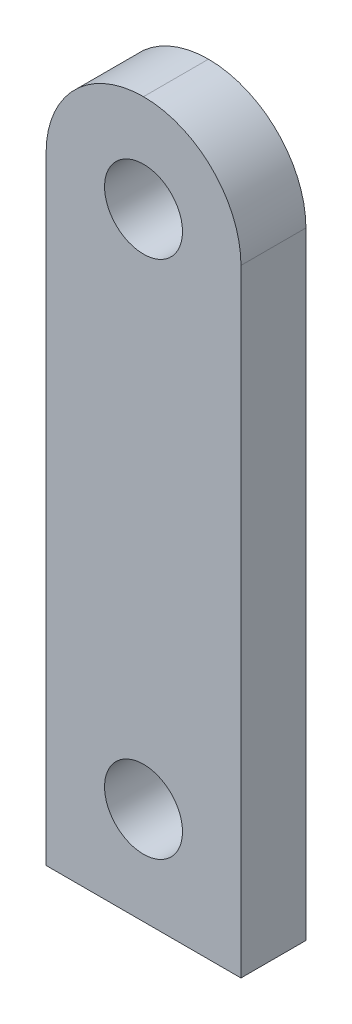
ISO-10303-21;
HEADER;
FILE_DESCRIPTION(('STEP AP214'),'2;1');
FILE_NAME('part.step','',(''),(''),'','','');
FILE_SCHEMA(('AUTOMOTIVE_DESIGN { 1 0 10303 214 1 1 1 1 }'));
ENDSEC;
DATA;
#1=APPLICATION_CONTEXT('core data for automotive mechanical design processes');
#2=APPLICATION_PROTOCOL_DEFINITION('international standard','automotive_design',2000,#1);
#3=PRODUCT_CONTEXT('',#1,'mechanical');
#4=PRODUCT('Part','Part','',(#3));
#5=PRODUCT_RELATED_PRODUCT_CATEGORY('part','',(#4));
#6=PRODUCT_DEFINITION_FORMATION('','',#4);
#7=PRODUCT_DEFINITION_CONTEXT('part definition',#1,'design');
#8=PRODUCT_DEFINITION('design','',#6,#7);
#9=PRODUCT_DEFINITION_SHAPE('','',#8);
#10=(LENGTH_UNIT() NAMED_UNIT(*) SI_UNIT(.MILLI.,.METRE.));
#11=(NAMED_UNIT(*) PLANE_ANGLE_UNIT() SI_UNIT($,.RADIAN.));
#12=(NAMED_UNIT(*) SI_UNIT($,.STERADIAN.) SOLID_ANGLE_UNIT());
#13=UNCERTAINTY_MEASURE_WITH_UNIT(LENGTH_MEASURE(1.E-05),#10,'distance_accuracy_value','');
#14=(GEOMETRIC_REPRESENTATION_CONTEXT(3) GLOBAL_UNCERTAINTY_ASSIGNED_CONTEXT((#13)) GLOBAL_UNIT_ASSIGNED_CONTEXT((#10,
#11,#12)) REPRESENTATION_CONTEXT('',''));
#15=CARTESIAN_POINT('',(0.,0.,0.));
#16=DIRECTION('',(0.,0.,1.));
#17=DIRECTION('',(1.,0.,0.));
#18=AXIS2_PLACEMENT_3D('',#15,#16,#17);
#19=CARTESIAN_POINT('',(0.,0.,10.));
#20=DIRECTION('',(0.,0.,-1.));
#21=DIRECTION('',(-1.,0.,0.));
#22=AXIS2_PLACEMENT_3D('',#19,#20,#21);
#23=PLANE('',#22);
#24=CARTESIAN_POINT('',(-15.,-15.,10.));
#25=DIRECTION('',(0.,0.,1.));
#26=DIRECTION('',(1.,0.,0.));
#27=AXIS2_PLACEMENT_3D('',#24,#25,#26);
#28=CIRCLE('',#27,6.);
#29=CARTESIAN_POINT('',(-8.99999999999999,-15.,10.));
#30=VERTEX_POINT('',#29);
#31=EDGE_CURVE('E109',#30,#30,#28,.T.);
#32=ORIENTED_EDGE('',*,*,#31,.F.);
#33=EDGE_LOOP('',(#32));
#34=FACE_BOUND('',#33,.T.);
#35=CARTESIAN_POINT('',(-15.,-15.,10.));
#36=DIRECTION('',(0.,0.,-1.));
#37=DIRECTION('',(-1.,0.,0.));
#38=AXIS2_PLACEMENT_3D('',#35,#36,#37);
#39=CIRCLE('',#38,15.);
#40=CARTESIAN_POINT('',(0.,-15.,10.));
#41=VERTEX_POINT('',#40);
#42=CARTESIAN_POINT('',(-15.,0.,10.));
#43=VERTEX_POINT('',#42);
#44=EDGE_CURVE('E53',#41,#43,#39,.F.);
#45=ORIENTED_EDGE('',*,*,#44,.T.);
#46=CARTESIAN_POINT('',(-15.,-15.,10.));
#47=DIRECTION('',(0.,0.,-1.));
#48=DIRECTION('',(-1.,0.,0.));
#49=AXIS2_PLACEMENT_3D('',#46,#47,#48);
#50=CIRCLE('',#49,15.);
#51=CARTESIAN_POINT('',(-30.,-15.,10.));
#52=VERTEX_POINT('',#51);
#53=EDGE_CURVE('E41',#43,#52,#50,.F.);
#54=ORIENTED_EDGE('',*,*,#53,.T.);
#55=DIRECTION('',(0.,-1.,0.));
#56=VECTOR('',#55,1.);
#57=CARTESIAN_POINT('',(-30.,0.,10.));
#58=LINE('',#57,#56);
#59=CARTESIAN_POINT('',(-30.,-110.,10.));
#60=VERTEX_POINT('',#59);
#61=EDGE_CURVE('E78',#52,#60,#58,.T.);
#62=ORIENTED_EDGE('',*,*,#61,.T.);
#63=DIRECTION('',(1.,0.,0.));
#64=VECTOR('',#63,1.);
#65=CARTESIAN_POINT('',(-30.,-110.,10.));
#66=LINE('',#65,#64);
#67=CARTESIAN_POINT('',(0.,-110.,10.));
#68=VERTEX_POINT('',#67);
#69=EDGE_CURVE('E82',#60,#68,#66,.T.);
#70=ORIENTED_EDGE('',*,*,#69,.T.);
#71=DIRECTION('',(0.,1.,0.));
#72=VECTOR('',#71,1.);
#73=CARTESIAN_POINT('',(0.,-110.,10.));
#74=LINE('',#73,#72);
#75=EDGE_CURVE('E102',#68,#41,#74,.T.);
#76=ORIENTED_EDGE('',*,*,#75,.T.);
#77=EDGE_LOOP('',(#45,#54,#62,#70,#76));
#78=FACE_BOUND('',#77,.T.);
#79=CARTESIAN_POINT('',(-15.,-95.,10.));
#80=DIRECTION('',(0.,0.,1.));
#81=DIRECTION('',(1.,0.,0.));
#82=AXIS2_PLACEMENT_3D('',#79,#80,#81);
#83=CIRCLE('',#82,6.00000000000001);
#84=CARTESIAN_POINT('',(-8.99999999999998,-95.,10.));
#85=VERTEX_POINT('',#84);
#86=EDGE_CURVE('E130',#85,#85,#83,.T.);
#87=ORIENTED_EDGE('',*,*,#86,.F.);
#88=EDGE_LOOP('',(#87));
#89=FACE_BOUND('',#88,.T.);
#90=ADVANCED_FACE('F32',(#34,#78,#89),#23,.F.);
#91=CARTESIAN_POINT('',(0.,0.,0.));
#92=DIRECTION('',(0.,0.,-1.));
#93=DIRECTION('',(-1.,0.,0.));
#94=AXIS2_PLACEMENT_3D('',#91,#92,#93);
#95=PLANE('',#94);
#96=CARTESIAN_POINT('',(-15.,-15.,0.));
#97=DIRECTION('',(0.,0.,1.));
#98=DIRECTION('',(1.,0.,0.));
#99=AXIS2_PLACEMENT_3D('',#96,#97,#98);
#100=CIRCLE('',#99,6.);
#101=CARTESIAN_POINT('',(-8.99999999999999,-15.,0.));
#102=VERTEX_POINT('',#101);
#103=EDGE_CURVE('E134',#102,#102,#100,.T.);
#104=ORIENTED_EDGE('',*,*,#103,.T.);
#105=EDGE_LOOP('',(#104));
#106=FACE_BOUND('',#105,.T.);
#107=DIRECTION('',(0.,-1.,0.));
#108=VECTOR('',#107,1.);
#109=CARTESIAN_POINT('',(-30.,0.,0.));
#110=LINE('',#109,#108);
#111=CARTESIAN_POINT('',(-30.,-15.,0.));
#112=VERTEX_POINT('',#111);
#113=CARTESIAN_POINT('',(-30.,-110.,0.));
#114=VERTEX_POINT('',#113);
#115=EDGE_CURVE('E94',#112,#114,#110,.T.);
#116=ORIENTED_EDGE('',*,*,#115,.F.);
#117=CARTESIAN_POINT('',(-15.,-15.,0.));
#118=DIRECTION('',(0.,0.,-1.));
#119=DIRECTION('',(-1.,0.,0.));
#120=AXIS2_PLACEMENT_3D('',#117,#118,#119);
#121=CIRCLE('',#120,15.);
#122=CARTESIAN_POINT('',(-15.,0.,0.));
#123=VERTEX_POINT('',#122);
#124=EDGE_CURVE('E116',#112,#123,#121,.T.);
#125=ORIENTED_EDGE('',*,*,#124,.T.);
#126=CARTESIAN_POINT('',(-15.,-15.,0.));
#127=DIRECTION('',(0.,0.,-1.));
#128=DIRECTION('',(-1.,0.,0.));
#129=AXIS2_PLACEMENT_3D('',#126,#127,#128);
#130=CIRCLE('',#129,15.);
#131=CARTESIAN_POINT('',(0.,-15.,0.));
#132=VERTEX_POINT('',#131);
#133=EDGE_CURVE('E114',#123,#132,#130,.T.);
#134=ORIENTED_EDGE('',*,*,#133,.T.);
#135=DIRECTION('',(0.,1.,0.));
#136=VECTOR('',#135,1.);
#137=CARTESIAN_POINT('',(0.,-110.,0.));
#138=LINE('',#137,#136);
#139=CARTESIAN_POINT('',(0.,-110.,0.));
#140=VERTEX_POINT('',#139);
#141=EDGE_CURVE('E88',#140,#132,#138,.T.);
#142=ORIENTED_EDGE('',*,*,#141,.F.);
#143=DIRECTION('',(1.,0.,0.));
#144=VECTOR('',#143,1.);
#145=CARTESIAN_POINT('',(-30.,-110.,0.));
#146=LINE('',#145,#144);
#147=EDGE_CURVE('E108',#114,#140,#146,.T.);
#148=ORIENTED_EDGE('',*,*,#147,.F.);
#149=EDGE_LOOP('',(#116,#125,#134,#142,#148));
#150=FACE_BOUND('',#149,.T.);
#151=CARTESIAN_POINT('',(-15.,-95.,0.));
#152=DIRECTION('',(0.,0.,1.));
#153=DIRECTION('',(1.,0.,0.));
#154=AXIS2_PLACEMENT_3D('',#151,#152,#153);
#155=CIRCLE('',#154,6.00000000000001);
#156=CARTESIAN_POINT('',(-8.99999999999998,-95.,0.));
#157=VERTEX_POINT('',#156);
#158=EDGE_CURVE('E128',#157,#157,#155,.T.);
#159=ORIENTED_EDGE('',*,*,#158,.T.);
#160=EDGE_LOOP('',(#159));
#161=FACE_BOUND('',#160,.T.);
#162=ADVANCED_FACE('F121',(#106,#150,#161),#95,.T.);
#163=CARTESIAN_POINT('',(-30.,0.,10.));
#164=DIRECTION('',(1.,0.,0.));
#165=DIRECTION('',(0.,1.,0.));
#166=AXIS2_PLACEMENT_3D('',#163,#164,#165);
#167=PLANE('',#166);
#168=ORIENTED_EDGE('',*,*,#61,.F.);
#169=DIRECTION('',(0.,0.,-1.));
#170=VECTOR('',#169,1.);
#171=CARTESIAN_POINT('',(-30.,-15.,10.));
#172=LINE('',#171,#170);
#173=EDGE_CURVE('E97',#52,#112,#172,.T.);
#174=ORIENTED_EDGE('',*,*,#173,.T.);
#175=ORIENTED_EDGE('',*,*,#115,.T.);
#176=DIRECTION('',(0.,0.,-1.));
#177=VECTOR('',#176,1.);
#178=CARTESIAN_POINT('',(-30.,-110.,10.));
#179=LINE('',#178,#177);
#180=EDGE_CURVE('E91',#60,#114,#179,.T.);
#181=ORIENTED_EDGE('',*,*,#180,.F.);
#182=EDGE_LOOP('',(#168,#174,#175,#181));
#183=FACE_BOUND('',#182,.T.);
#184=ADVANCED_FACE('F92',(#183),#167,.F.);
#185=CARTESIAN_POINT('',(-30.,-110.,10.));
#186=DIRECTION('',(0.,1.,0.));
#187=DIRECTION('',(0.,0.,1.));
#188=AXIS2_PLACEMENT_3D('',#185,#186,#187);
#189=PLANE('',#188);
#190=ORIENTED_EDGE('',*,*,#147,.T.);
#191=DIRECTION('',(0.,0.,-1.));
#192=VECTOR('',#191,1.);
#193=CARTESIAN_POINT('',(0.,-110.,10.));
#194=LINE('',#193,#192);
#195=EDGE_CURVE('E98',#68,#140,#194,.T.);
#196=ORIENTED_EDGE('',*,*,#195,.F.);
#197=ORIENTED_EDGE('',*,*,#69,.F.);
#198=ORIENTED_EDGE('',*,*,#180,.T.);
#199=EDGE_LOOP('',(#190,#196,#197,#198));
#200=FACE_BOUND('',#199,.T.);
#201=ADVANCED_FACE('F100',(#200),#189,.F.);
#202=CARTESIAN_POINT('',(0.,-110.,10.));
#203=DIRECTION('',(-1.,0.,0.));
#204=DIRECTION('',(0.,0.,1.));
#205=AXIS2_PLACEMENT_3D('',#202,#203,#204);
#206=PLANE('',#205);
#207=ORIENTED_EDGE('',*,*,#141,.T.);
#208=DIRECTION('',(0.,0.,-1.));
#209=VECTOR('',#208,1.);
#210=CARTESIAN_POINT('',(0.,-15.,10.));
#211=LINE('',#210,#209);
#212=EDGE_CURVE('E11',#132,#41,#211,.F.);
#213=ORIENTED_EDGE('',*,*,#212,.T.);
#214=ORIENTED_EDGE('',*,*,#75,.F.);
#215=ORIENTED_EDGE('',*,*,#195,.T.);
#216=EDGE_LOOP('',(#207,#213,#214,#215));
#217=FACE_BOUND('',#216,.T.);
#218=ADVANCED_FACE('F145',(#217),#206,.F.);
#219=CARTESIAN_POINT('',(-15.,-15.,10.));
#220=DIRECTION('',(0.,0.,-1.));
#221=DIRECTION('',(-1.,0.,0.));
#222=AXIS2_PLACEMENT_3D('',#219,#220,#221);
#223=CYLINDRICAL_SURFACE('',#222,6.);
#224=ORIENTED_EDGE('',*,*,#31,.T.);
#225=EDGE_LOOP('',(#224));
#226=FACE_BOUND('',#225,.T.);
#227=ORIENTED_EDGE('',*,*,#103,.F.);
#228=EDGE_LOOP('',(#227));
#229=FACE_BOUND('',#228,.T.);
#230=ADVANCED_FACE('F142',(#226,#229),#223,.F.);
#231=CARTESIAN_POINT('',(-15.,-95.,10.));
#232=DIRECTION('',(0.,0.,-1.));
#233=DIRECTION('',(-1.,0.,0.));
#234=AXIS2_PLACEMENT_3D('',#231,#232,#233);
#235=CYLINDRICAL_SURFACE('',#234,6.00000000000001);
#236=ORIENTED_EDGE('',*,*,#86,.T.);
#237=EDGE_LOOP('',(#236));
#238=FACE_BOUND('',#237,.T.);
#239=ORIENTED_EDGE('',*,*,#158,.F.);
#240=EDGE_LOOP('',(#239));
#241=FACE_BOUND('',#240,.T.);
#242=ADVANCED_FACE('F144',(#238,#241),#235,.F.);
#243=CARTESIAN_POINT('',(-15.,-15.,10.));
#244=DIRECTION('',(0.,0.,-1.));
#245=DIRECTION('',(-1.,0.,0.));
#246=AXIS2_PLACEMENT_3D('',#243,#244,#245);
#247=CYLINDRICAL_SURFACE('',#246,15.);
#248=DIRECTION('',(0.,0.,-1.));
#249=VECTOR('',#248,1.);
#250=CARTESIAN_POINT('',(-15.,0.,10.));
#251=LINE('',#250,#249);
#252=EDGE_CURVE('E36',#43,#123,#251,.T.);
#253=ORIENTED_EDGE('',*,*,#252,.F.);
#254=ORIENTED_EDGE('',*,*,#44,.F.);
#255=ORIENTED_EDGE('',*,*,#212,.F.);
#256=ORIENTED_EDGE('',*,*,#133,.F.);
#257=EDGE_LOOP('',(#253,#254,#255,#256));
#258=FACE_BOUND('',#257,.T.);
#259=ADVANCED_FACE('F34',(#258),#247,.T.);
#260=CARTESIAN_POINT('',(-15.,-15.,10.));
#261=DIRECTION('',(0.,0.,-1.));
#262=DIRECTION('',(-1.,0.,0.));
#263=AXIS2_PLACEMENT_3D('',#260,#261,#262);
#264=CYLINDRICAL_SURFACE('',#263,15.);
#265=ORIENTED_EDGE('',*,*,#53,.F.);
#266=ORIENTED_EDGE('',*,*,#252,.T.);
#267=ORIENTED_EDGE('',*,*,#124,.F.);
#268=ORIENTED_EDGE('',*,*,#173,.F.);
#269=EDGE_LOOP('',(#265,#266,#267,#268));
#270=FACE_BOUND('',#269,.T.);
#271=ADVANCED_FACE('F127',(#270),#264,.T.);
#272=CLOSED_SHELL('',(#90,#162,#184,#201,#218,#230,#242,#259,#271));
#273=MANIFOLD_SOLID_BREP('B2',#272);
#274=ADVANCED_BREP_SHAPE_REPRESENTATION('',(#18,#273),#14);
#275=SHAPE_DEFINITION_REPRESENTATION(#9,#274);
ENDSEC;
END-ISO-10303-21;
